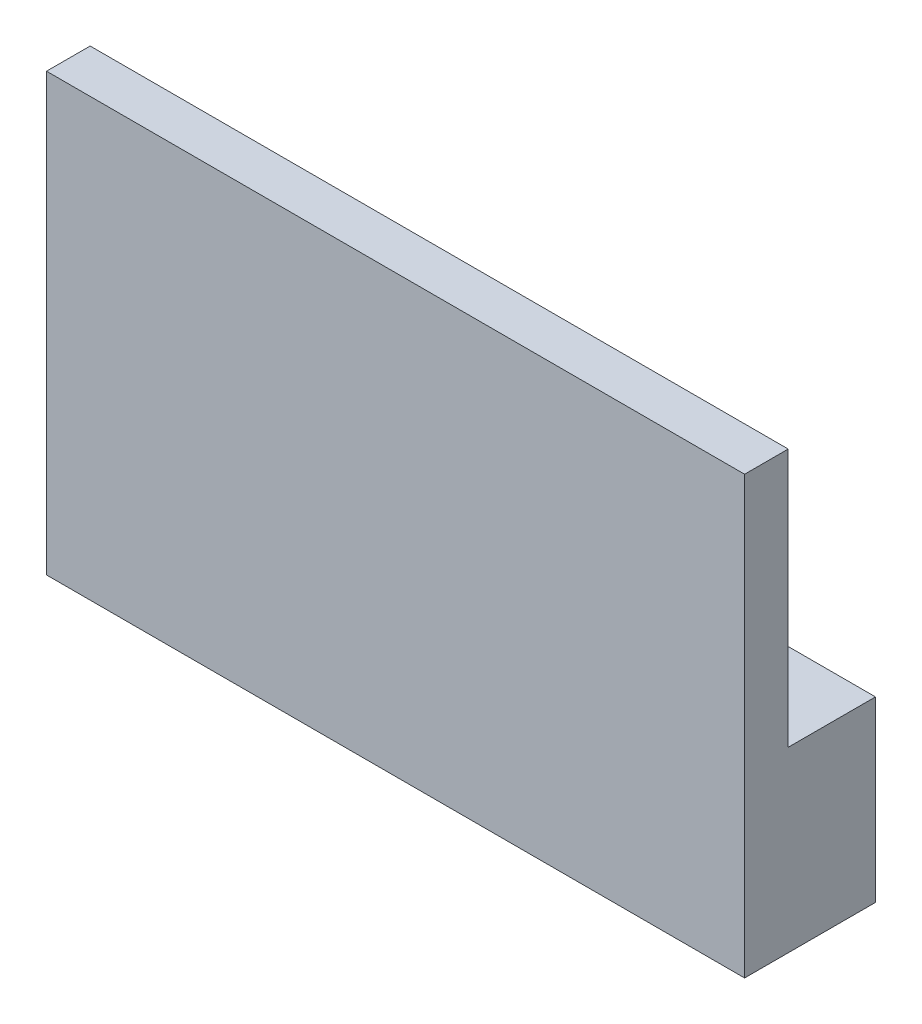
ISO-10303-21;
HEADER;
FILE_DESCRIPTION(('STEP AP214'),'2;1');
FILE_NAME('part.step','',(''),(''),'','','');
FILE_SCHEMA(('AUTOMOTIVE_DESIGN { 1 0 10303 214 1 1 1 1 }'));
ENDSEC;
DATA;
#1=APPLICATION_CONTEXT('core data for automotive mechanical design processes');
#2=APPLICATION_PROTOCOL_DEFINITION('international standard','automotive_design',2000,#1);
#3=PRODUCT_CONTEXT('',#1,'mechanical');
#4=PRODUCT('Part','Part','',(#3));
#5=PRODUCT_RELATED_PRODUCT_CATEGORY('part','',(#4));
#6=PRODUCT_DEFINITION_FORMATION('','',#4);
#7=PRODUCT_DEFINITION_CONTEXT('part definition',#1,'design');
#8=PRODUCT_DEFINITION('design','',#6,#7);
#9=PRODUCT_DEFINITION_SHAPE('','',#8);
#10=(LENGTH_UNIT() NAMED_UNIT(*) SI_UNIT(.MILLI.,.METRE.));
#11=(NAMED_UNIT(*) PLANE_ANGLE_UNIT() SI_UNIT($,.RADIAN.));
#12=(NAMED_UNIT(*) SI_UNIT($,.STERADIAN.) SOLID_ANGLE_UNIT());
#13=UNCERTAINTY_MEASURE_WITH_UNIT(LENGTH_MEASURE(1.E-05),#10,'distance_accuracy_value','');
#14=(GEOMETRIC_REPRESENTATION_CONTEXT(3) GLOBAL_UNCERTAINTY_ASSIGNED_CONTEXT((#13)) GLOBAL_UNIT_ASSIGNED_CONTEXT((#10,
#11,#12)) REPRESENTATION_CONTEXT('',''));
#15=CARTESIAN_POINT('',(0.,0.,0.));
#16=DIRECTION('',(0.,0.,1.));
#17=DIRECTION('',(1.,0.,0.));
#18=AXIS2_PLACEMENT_3D('',#15,#16,#17);
#19=CARTESIAN_POINT('',(0.,0.,3.175));
#20=DIRECTION('',(1.,0.,0.));
#21=DIRECTION('',(0.,1.,0.));
#22=AXIS2_PLACEMENT_3D('',#19,#20,#21);
#23=PLANE('',#22);
#24=DIRECTION('',(0.,-1.,0.));
#25=VECTOR('',#24,1.);
#26=CARTESIAN_POINT('',(0.,0.,0.));
#27=LINE('',#26,#25);
#28=CARTESIAN_POINT('',(0.,31.75,0.));
#29=VERTEX_POINT('',#28);
#30=CARTESIAN_POINT('',(0.,12.954,0.));
#31=VERTEX_POINT('',#30);
#32=EDGE_CURVE('E134',#29,#31,#27,.T.);
#33=ORIENTED_EDGE('',*,*,#32,.T.);
#34=DIRECTION('',(0.,0.,1.));
#35=VECTOR('',#34,1.);
#36=CARTESIAN_POINT('',(0.,12.954,-6.35));
#37=LINE('',#36,#35);
#38=CARTESIAN_POINT('',(0.,12.954,-6.35));
#39=VERTEX_POINT('',#38);
#40=EDGE_CURVE('E131',#39,#31,#37,.T.);
#41=ORIENTED_EDGE('',*,*,#40,.F.);
#42=DIRECTION('',(0.,1.,0.));
#43=VECTOR('',#42,1.);
#44=CARTESIAN_POINT('',(0.,0.,-6.35));
#45=LINE('',#44,#43);
#46=CARTESIAN_POINT('',(0.,0.,-6.35));
#47=VERTEX_POINT('',#46);
#48=EDGE_CURVE('E118',#47,#39,#45,.T.);
#49=ORIENTED_EDGE('',*,*,#48,.F.);
#50=DIRECTION('',(0.,0.,-1.));
#51=VECTOR('',#50,1.);
#52=CARTESIAN_POINT('',(0.,0.,3.175));
#53=LINE('',#52,#51);
#54=CARTESIAN_POINT('',(0.,0.,3.175));
#55=VERTEX_POINT('',#54);
#56=EDGE_CURVE('E11',#55,#47,#53,.T.);
#57=ORIENTED_EDGE('',*,*,#56,.F.);
#58=DIRECTION('',(0.,-1.,0.));
#59=VECTOR('',#58,1.);
#60=CARTESIAN_POINT('',(0.,0.,3.175));
#61=LINE('',#60,#59);
#62=CARTESIAN_POINT('',(0.,31.75,3.175));
#63=VERTEX_POINT('',#62);
#64=EDGE_CURVE('E135',#63,#55,#61,.T.);
#65=ORIENTED_EDGE('',*,*,#64,.F.);
#66=DIRECTION('',(0.,0.,-1.));
#67=VECTOR('',#66,1.);
#68=CARTESIAN_POINT('',(0.,31.75,3.175));
#69=LINE('',#68,#67);
#70=EDGE_CURVE('E140',#63,#29,#69,.T.);
#71=ORIENTED_EDGE('',*,*,#70,.T.);
#72=EDGE_LOOP('',(#33,#41,#49,#57,#65,#71));
#73=FACE_BOUND('',#72,.T.);
#74=ADVANCED_FACE('F43',(#73),#23,.F.);
#75=CARTESIAN_POINT('',(0.,0.,3.175));
#76=DIRECTION('',(0.,1.,0.));
#77=DIRECTION('',(0.,0.,1.));
#78=AXIS2_PLACEMENT_3D('',#75,#76,#77);
#79=PLANE('',#78);
#80=ORIENTED_EDGE('',*,*,#56,.T.);
#81=DIRECTION('',(-1.,0.,0.));
#82=VECTOR('',#81,1.);
#83=CARTESIAN_POINT('',(50.8,0.,-6.35));
#84=LINE('',#83,#82);
#85=CARTESIAN_POINT('',(50.8,0.,-6.35));
#86=VERTEX_POINT('',#85);
#87=EDGE_CURVE('E113',#86,#47,#84,.T.);
#88=ORIENTED_EDGE('',*,*,#87,.F.);
#89=DIRECTION('',(0.,0.,-1.));
#90=VECTOR('',#89,1.);
#91=CARTESIAN_POINT('',(50.8,0.,3.175));
#92=LINE('',#91,#90);
#93=CARTESIAN_POINT('',(50.8,0.,3.175));
#94=VERTEX_POINT('',#93);
#95=EDGE_CURVE('E50',#94,#86,#92,.T.);
#96=ORIENTED_EDGE('',*,*,#95,.F.);
#97=DIRECTION('',(1.,0.,0.));
#98=VECTOR('',#97,1.);
#99=CARTESIAN_POINT('',(0.,0.,3.175));
#100=LINE('',#99,#98);
#101=EDGE_CURVE('E88',#55,#94,#100,.T.);
#102=ORIENTED_EDGE('',*,*,#101,.F.);
#103=EDGE_LOOP('',(#80,#88,#96,#102));
#104=FACE_BOUND('',#103,.T.);
#105=ADVANCED_FACE('F114',(#104),#79,.F.);
#106=CARTESIAN_POINT('',(50.8,0.,3.175));
#107=DIRECTION('',(-1.,0.,0.));
#108=DIRECTION('',(0.,-1.,0.));
#109=AXIS2_PLACEMENT_3D('',#106,#107,#108);
#110=PLANE('',#109);
#111=ORIENTED_EDGE('',*,*,#95,.T.);
#112=DIRECTION('',(0.,-1.,0.));
#113=VECTOR('',#112,1.);
#114=CARTESIAN_POINT('',(50.8,0.,-6.35));
#115=LINE('',#114,#113);
#116=CARTESIAN_POINT('',(50.8,12.954,-6.35));
#117=VERTEX_POINT('',#116);
#118=EDGE_CURVE('E108',#117,#86,#115,.T.);
#119=ORIENTED_EDGE('',*,*,#118,.F.);
#120=DIRECTION('',(0.,0.,1.));
#121=VECTOR('',#120,1.);
#122=CARTESIAN_POINT('',(50.8,12.954,-6.35));
#123=LINE('',#122,#121);
#124=CARTESIAN_POINT('',(50.8,12.954,0.));
#125=VERTEX_POINT('',#124);
#126=EDGE_CURVE('E128',#117,#125,#123,.T.);
#127=ORIENTED_EDGE('',*,*,#126,.T.);
#128=DIRECTION('',(0.,1.,0.));
#129=VECTOR('',#128,1.);
#130=CARTESIAN_POINT('',(50.8,0.,0.));
#131=LINE('',#130,#129);
#132=CARTESIAN_POINT('',(50.8,31.75,0.));
#133=VERTEX_POINT('',#132);
#134=EDGE_CURVE('E142',#125,#133,#131,.T.);
#135=ORIENTED_EDGE('',*,*,#134,.T.);
#136=DIRECTION('',(0.,0.,-1.));
#137=VECTOR('',#136,1.);
#138=CARTESIAN_POINT('',(50.8,31.75,3.175));
#139=LINE('',#138,#137);
#140=CARTESIAN_POINT('',(50.8,31.75,3.175));
#141=VERTEX_POINT('',#140);
#142=EDGE_CURVE('E111',#141,#133,#139,.T.);
#143=ORIENTED_EDGE('',*,*,#142,.F.);
#144=DIRECTION('',(0.,1.,0.));
#145=VECTOR('',#144,1.);
#146=CARTESIAN_POINT('',(50.8,0.,3.175));
#147=LINE('',#146,#145);
#148=EDGE_CURVE('E110',#94,#141,#147,.T.);
#149=ORIENTED_EDGE('',*,*,#148,.F.);
#150=EDGE_LOOP('',(#111,#119,#127,#135,#143,#149));
#151=FACE_BOUND('',#150,.T.);
#152=ADVANCED_FACE('F105',(#151),#110,.F.);
#153=CARTESIAN_POINT('',(0.,31.75,3.175));
#154=DIRECTION('',(0.,-1.,0.));
#155=DIRECTION('',(0.,0.,-1.));
#156=AXIS2_PLACEMENT_3D('',#153,#154,#155);
#157=PLANE('',#156);
#158=DIRECTION('',(-1.,0.,0.));
#159=VECTOR('',#158,1.);
#160=CARTESIAN_POINT('',(0.,31.75,0.));
#161=LINE('',#160,#159);
#162=EDGE_CURVE('E81',#133,#29,#161,.T.);
#163=ORIENTED_EDGE('',*,*,#162,.T.);
#164=ORIENTED_EDGE('',*,*,#70,.F.);
#165=DIRECTION('',(-1.,0.,0.));
#166=VECTOR('',#165,1.);
#167=CARTESIAN_POINT('',(0.,31.75,3.175));
#168=LINE('',#167,#166);
#169=EDGE_CURVE('E66',#141,#63,#168,.T.);
#170=ORIENTED_EDGE('',*,*,#169,.F.);
#171=ORIENTED_EDGE('',*,*,#142,.T.);
#172=EDGE_LOOP('',(#163,#164,#170,#171));
#173=FACE_BOUND('',#172,.T.);
#174=ADVANCED_FACE('F146',(#173),#157,.F.);
#175=CARTESIAN_POINT('',(0.,0.,3.175));
#176=DIRECTION('',(0.,0.,-1.));
#177=DIRECTION('',(-1.,0.,0.));
#178=AXIS2_PLACEMENT_3D('',#175,#176,#177);
#179=PLANE('',#178);
#180=ORIENTED_EDGE('',*,*,#64,.T.);
#181=ORIENTED_EDGE('',*,*,#101,.T.);
#182=ORIENTED_EDGE('',*,*,#148,.T.);
#183=ORIENTED_EDGE('',*,*,#169,.T.);
#184=EDGE_LOOP('',(#180,#181,#182,#183));
#185=FACE_BOUND('',#184,.T.);
#186=ADVANCED_FACE('F160',(#185),#179,.F.);
#187=CARTESIAN_POINT('',(0.,0.,0.));
#188=DIRECTION('',(0.,0.,-1.));
#189=DIRECTION('',(-1.,0.,0.));
#190=AXIS2_PLACEMENT_3D('',#187,#188,#189);
#191=PLANE('',#190);
#192=DIRECTION('',(1.,0.,0.));
#193=VECTOR('',#192,1.);
#194=CARTESIAN_POINT('',(50.8,12.954,0.));
#195=LINE('',#194,#193);
#196=EDGE_CURVE('E57',#31,#125,#195,.T.);
#197=ORIENTED_EDGE('',*,*,#196,.F.);
#198=ORIENTED_EDGE('',*,*,#32,.F.);
#199=ORIENTED_EDGE('',*,*,#162,.F.);
#200=ORIENTED_EDGE('',*,*,#134,.F.);
#201=EDGE_LOOP('',(#197,#198,#199,#200));
#202=FACE_BOUND('',#201,.T.);
#203=ADVANCED_FACE('F147',(#202),#191,.T.);
#204=CARTESIAN_POINT('',(50.8,12.954,-6.35));
#205=DIRECTION('',(0.,-1.,0.));
#206=DIRECTION('',(0.,0.,-1.));
#207=AXIS2_PLACEMENT_3D('',#204,#205,#206);
#208=PLANE('',#207);
#209=ORIENTED_EDGE('',*,*,#196,.T.);
#210=ORIENTED_EDGE('',*,*,#126,.F.);
#211=DIRECTION('',(1.,0.,0.));
#212=VECTOR('',#211,1.);
#213=CARTESIAN_POINT('',(50.8,12.954,-6.35));
#214=LINE('',#213,#212);
#215=EDGE_CURVE('E122',#39,#117,#214,.T.);
#216=ORIENTED_EDGE('',*,*,#215,.F.);
#217=ORIENTED_EDGE('',*,*,#40,.T.);
#218=EDGE_LOOP('',(#209,#210,#216,#217));
#219=FACE_BOUND('',#218,.T.);
#220=ADVANCED_FACE('F152',(#219),#208,.F.);
#221=CARTESIAN_POINT('',(0.,0.,-6.35));
#222=DIRECTION('',(0.,0.,1.));
#223=DIRECTION('',(1.,0.,0.));
#224=AXIS2_PLACEMENT_3D('',#221,#222,#223);
#225=PLANE('',#224);
#226=ORIENTED_EDGE('',*,*,#118,.T.);
#227=ORIENTED_EDGE('',*,*,#87,.T.);
#228=ORIENTED_EDGE('',*,*,#48,.T.);
#229=ORIENTED_EDGE('',*,*,#215,.T.);
#230=EDGE_LOOP('',(#226,#227,#228,#229));
#231=FACE_BOUND('',#230,.T.);
#232=ADVANCED_FACE('F120',(#231),#225,.F.);
#233=CLOSED_SHELL('',(#74,#105,#152,#174,#186,#203,#220,#232));
#234=MANIFOLD_SOLID_BREP('B2',#233);
#235=ADVANCED_BREP_SHAPE_REPRESENTATION('',(#18,#234),#14);
#236=SHAPE_DEFINITION_REPRESENTATION(#9,#235);
ENDSEC;
END-ISO-10303-21;
